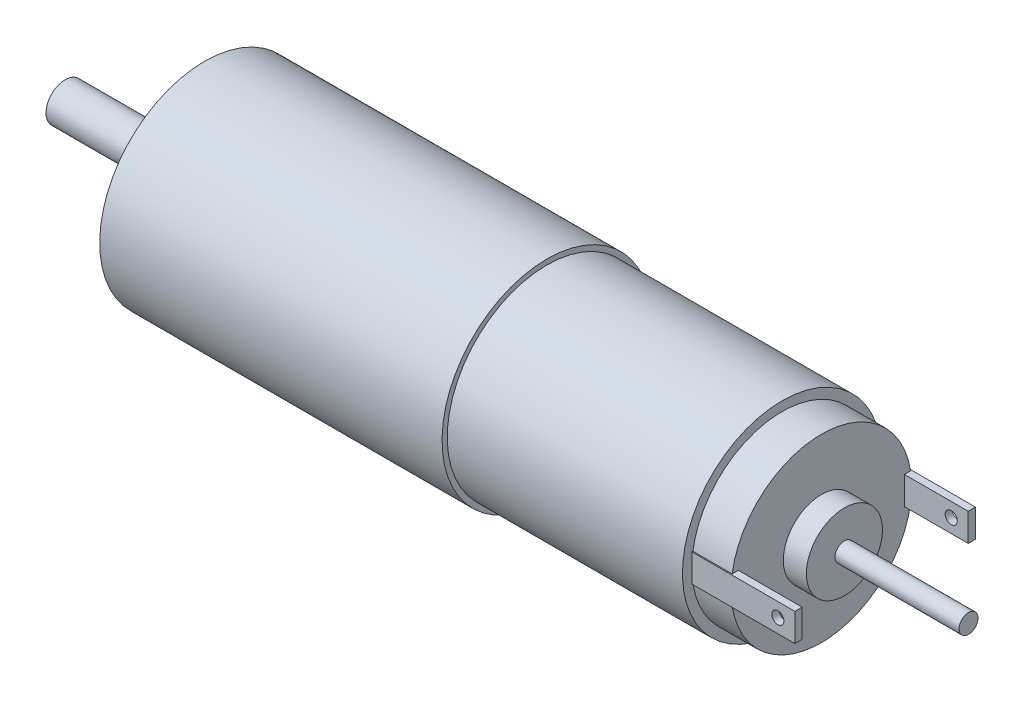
ISO-10303-21;
HEADER;
FILE_DESCRIPTION(('STEP AP214'),'2;1');
FILE_NAME('part.step','',(''),(''),'','','');
FILE_SCHEMA(('AUTOMOTIVE_DESIGN { 1 0 10303 214 1 1 1 1 }'));
ENDSEC;
DATA;
#1=APPLICATION_CONTEXT('core data for automotive mechanical design processes');
#2=APPLICATION_PROTOCOL_DEFINITION('international standard','automotive_design',2000,#1);
#3=PRODUCT_CONTEXT('',#1,'mechanical');
#4=PRODUCT('Part','Part','',(#3));
#5=PRODUCT_RELATED_PRODUCT_CATEGORY('part','',(#4));
#6=PRODUCT_DEFINITION_FORMATION('','',#4);
#7=PRODUCT_DEFINITION_CONTEXT('part definition',#1,'design');
#8=PRODUCT_DEFINITION('design','',#6,#7);
#9=PRODUCT_DEFINITION_SHAPE('','',#8);
#10=(LENGTH_UNIT() NAMED_UNIT(*) SI_UNIT(.MILLI.,.METRE.));
#11=(NAMED_UNIT(*) PLANE_ANGLE_UNIT() SI_UNIT($,.RADIAN.));
#12=(NAMED_UNIT(*) SI_UNIT($,.STERADIAN.) SOLID_ANGLE_UNIT());
#13=UNCERTAINTY_MEASURE_WITH_UNIT(LENGTH_MEASURE(1.E-05),#10,'distance_accuracy_value','');
#14=(GEOMETRIC_REPRESENTATION_CONTEXT(3) GLOBAL_UNCERTAINTY_ASSIGNED_CONTEXT((#13)) GLOBAL_UNIT_ASSIGNED_CONTEXT((#10,
#11,#12)) REPRESENTATION_CONTEXT('',''));
#15=CARTESIAN_POINT('',(0.,0.,0.));
#16=DIRECTION('',(0.,0.,1.));
#17=DIRECTION('',(1.,0.,0.));
#18=AXIS2_PLACEMENT_3D('',#15,#16,#17);
#19=CARTESIAN_POINT('',(35.433,1.4605,8.6995));
#20=DIRECTION('',(0.,0.,-1.));
#21=DIRECTION('',(-1.,0.,0.));
#22=AXIS2_PLACEMENT_3D('',#19,#20,#21);
#23=PLANE('',#22);
#24=DIRECTION('',(0.,-1.,0.));
#25=VECTOR('',#24,1.);
#26=CARTESIAN_POINT('',(28.7528,-9.4615,8.6995));
#27=LINE('',#26,#25);
#28=CARTESIAN_POINT('',(28.7528,1.4605,8.6995));
#29=VERTEX_POINT('',#28);
#30=CARTESIAN_POINT('',(28.7528,-1.4605,8.6995));
#31=VERTEX_POINT('',#30);
#32=EDGE_CURVE('E11',#29,#31,#27,.T.);
#33=ORIENTED_EDGE('',*,*,#32,.F.);
#34=DIRECTION('',(-1.,0.,0.));
#35=VECTOR('',#34,1.);
#36=CARTESIAN_POINT('',(35.433,1.4605,8.6995));
#37=LINE('',#36,#35);
#38=CARTESIAN_POINT('',(35.433,1.4605,8.6995));
#39=VERTEX_POINT('',#38);
#40=EDGE_CURVE('E191',#39,#29,#37,.T.);
#41=ORIENTED_EDGE('',*,*,#40,.F.);
#42=DIRECTION('',(0.,-1.,0.));
#43=VECTOR('',#42,1.);
#44=CARTESIAN_POINT('',(35.433,1.4605,8.6995));
#45=LINE('',#44,#43);
#46=CARTESIAN_POINT('',(35.433,-1.4605,8.6995));
#47=VERTEX_POINT('',#46);
#48=EDGE_CURVE('E170',#39,#47,#45,.T.);
#49=ORIENTED_EDGE('',*,*,#48,.T.);
#50=DIRECTION('',(-1.,0.,0.));
#51=VECTOR('',#50,1.);
#52=CARTESIAN_POINT('',(35.433,-1.4605,8.6995));
#53=LINE('',#52,#51);
#54=EDGE_CURVE('E182',#47,#31,#53,.T.);
#55=ORIENTED_EDGE('',*,*,#54,.T.);
#56=EDGE_LOOP('',(#33,#41,#49,#55));
#57=FACE_BOUND('',#56,.T.);
#58=CARTESIAN_POINT('',(33.655,0.,8.6995));
#59=DIRECTION('',(0.,0.,-1.));
#60=DIRECTION('',(-1.,0.,0.));
#61=AXIS2_PLACEMENT_3D('',#58,#59,#60);
#62=CIRCLE('',#61,0.634999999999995);
#63=CARTESIAN_POINT('',(33.02,0.,8.6995));
#64=VERTEX_POINT('',#63);
#65=EDGE_CURVE('E160',#64,#64,#62,.T.);
#66=ORIENTED_EDGE('',*,*,#65,.F.);
#67=EDGE_LOOP('',(#66));
#68=FACE_BOUND('',#67,.T.);
#69=ADVANCED_FACE('F36',(#57,#68),#23,.T.);
#70=CARTESIAN_POINT('',(35.433,1.4605,9.4615));
#71=DIRECTION('',(0.,0.,1.));
#72=DIRECTION('',(1.,0.,0.));
#73=AXIS2_PLACEMENT_3D('',#70,#71,#72);
#74=PLANE('',#73);
#75=DIRECTION('',(0.,1.,0.));
#76=VECTOR('',#75,1.);
#77=CARTESIAN_POINT('',(24.638,-10.4394,9.4615));
#78=LINE('',#77,#76);
#79=CARTESIAN_POINT('',(24.638,-1.4605,9.4615));
#80=VERTEX_POINT('',#79);
#81=CARTESIAN_POINT('',(24.638,1.4605,9.4615));
#82=VERTEX_POINT('',#81);
#83=EDGE_CURVE('E44',#80,#82,#78,.T.);
#84=ORIENTED_EDGE('',*,*,#83,.F.);
#85=DIRECTION('',(-1.,0.,0.));
#86=VECTOR('',#85,1.);
#87=CARTESIAN_POINT('',(35.433,-1.4605,9.4615));
#88=LINE('',#87,#86);
#89=CARTESIAN_POINT('',(35.433,-1.4605,9.4615));
#90=VERTEX_POINT('',#89);
#91=EDGE_CURVE('E187',#90,#80,#88,.T.);
#92=ORIENTED_EDGE('',*,*,#91,.F.);
#93=DIRECTION('',(0.,1.,0.));
#94=VECTOR('',#93,1.);
#95=CARTESIAN_POINT('',(35.433,1.4605,9.4615));
#96=LINE('',#95,#94);
#97=CARTESIAN_POINT('',(35.433,1.4605,9.4615));
#98=VERTEX_POINT('',#97);
#99=EDGE_CURVE('E176',#90,#98,#96,.T.);
#100=ORIENTED_EDGE('',*,*,#99,.T.);
#101=DIRECTION('',(-1.,0.,0.));
#102=VECTOR('',#101,1.);
#103=CARTESIAN_POINT('',(35.433,1.4605,9.4615));
#104=LINE('',#103,#102);
#105=EDGE_CURVE('E189',#98,#82,#104,.T.);
#106=ORIENTED_EDGE('',*,*,#105,.T.);
#107=EDGE_LOOP('',(#84,#92,#100,#106));
#108=FACE_BOUND('',#107,.T.);
#109=CARTESIAN_POINT('',(33.655,0.,9.4615));
#110=DIRECTION('',(0.,0.,-1.));
#111=DIRECTION('',(-1.,0.,0.));
#112=AXIS2_PLACEMENT_3D('',#109,#110,#111);
#113=CIRCLE('',#112,0.634999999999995);
#114=CARTESIAN_POINT('',(33.02,0.,9.4615));
#115=VERTEX_POINT('',#114);
#116=EDGE_CURVE('E157',#115,#115,#113,.T.);
#117=ORIENTED_EDGE('',*,*,#116,.T.);
#118=EDGE_LOOP('',(#117));
#119=FACE_BOUND('',#118,.T.);
#120=ADVANCED_FACE('F320',(#108,#119),#74,.T.);
#121=CARTESIAN_POINT('',(44.1706,0.,0.));
#122=DIRECTION('',(1.,0.,0.));
#123=DIRECTION('',(0.,1.,0.));
#124=AXIS2_PLACEMENT_3D('',#121,#122,#123);
#125=CYLINDRICAL_SURFACE('',#124,9.4615);
#126=CARTESIAN_POINT('',(24.638,0.,0.));
#127=DIRECTION('',(1.,0.,0.));
#128=DIRECTION('',(0.,1.,0.));
#129=AXIS2_PLACEMENT_3D('',#126,#127,#128);
#130=CIRCLE('',#129,9.4615);
#131=CARTESIAN_POINT('',(24.638,1.4605,-9.3480972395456));
#132=VERTEX_POINT('',#131);
#133=CARTESIAN_POINT('',(24.638,1.4605,9.3480972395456));
#134=VERTEX_POINT('',#133);
#135=EDGE_CURVE('E247',#132,#134,#130,.T.);
#136=ORIENTED_EDGE('',*,*,#135,.T.);
#137=DIRECTION('',(1.,0.,0.));
#138=VECTOR('',#137,1.);
#139=CARTESIAN_POINT('',(44.1706,1.4605,9.3480972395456));
#140=LINE('',#139,#138);
#141=CARTESIAN_POINT('',(28.7528,1.4605,9.3480972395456));
#142=VERTEX_POINT('',#141);
#143=EDGE_CURVE('E200',#134,#142,#140,.T.);
#144=ORIENTED_EDGE('',*,*,#143,.T.);
#145=CARTESIAN_POINT('',(28.7528,0.,0.));
#146=DIRECTION('',(1.,0.,0.));
#147=DIRECTION('',(0.,1.,0.));
#148=AXIS2_PLACEMENT_3D('',#145,#146,#147);
#149=CIRCLE('',#148,9.4615);
#150=CARTESIAN_POINT('',(28.7528,1.4605,-9.3480972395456));
#151=VERTEX_POINT('',#150);
#152=EDGE_CURVE('E251',#151,#142,#149,.T.);
#153=ORIENTED_EDGE('',*,*,#152,.F.);
#154=DIRECTION('',(1.,0.,0.));
#155=VECTOR('',#154,1.);
#156=CARTESIAN_POINT('',(44.1706,1.4605,-9.3480972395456));
#157=LINE('',#156,#155);
#158=EDGE_CURVE('E230',#132,#151,#157,.T.);
#159=ORIENTED_EDGE('',*,*,#158,.F.);
#160=EDGE_LOOP('',(#136,#144,#153,#159));
#161=FACE_BOUND('',#160,.T.);
#162=ADVANCED_FACE('F326',(#161),#125,.T.);
#163=CARTESIAN_POINT('',(28.7528,-9.4615,0.));
#164=DIRECTION('',(-1.,0.,0.));
#165=DIRECTION('',(0.,-1.,0.));
#166=AXIS2_PLACEMENT_3D('',#163,#164,#165);
#167=PLANE('',#166);
#168=CARTESIAN_POINT('',(28.7528,0.,0.));
#169=DIRECTION('',(1.,0.,0.));
#170=DIRECTION('',(0.,1.,0.));
#171=AXIS2_PLACEMENT_3D('',#168,#169,#170);
#172=CIRCLE('',#171,3.9878);
#173=CARTESIAN_POINT('',(28.7528,3.9878,0.));
#174=VERTEX_POINT('',#173);
#175=EDGE_CURVE('E254',#174,#174,#172,.T.);
#176=ORIENTED_EDGE('',*,*,#175,.F.);
#177=EDGE_LOOP('',(#176));
#178=FACE_BOUND('',#177,.T.);
#179=ORIENTED_EDGE('',*,*,#152,.T.);
#180=DIRECTION('',(0.,0.,-1.));
#181=VECTOR('',#180,1.);
#182=CARTESIAN_POINT('',(28.7528,1.4605,0.));
#183=LINE('',#182,#181);
#184=EDGE_CURVE('E203',#142,#29,#183,.T.);
#185=ORIENTED_EDGE('',*,*,#184,.T.);
#186=ORIENTED_EDGE('',*,*,#32,.T.);
#187=DIRECTION('',(0.,0.,1.));
#188=VECTOR('',#187,1.);
#189=CARTESIAN_POINT('',(28.7528,-1.4605,0.));
#190=LINE('',#189,#188);
#191=CARTESIAN_POINT('',(28.7528,-1.4605,9.3480972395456));
#192=VERTEX_POINT('',#191);
#193=EDGE_CURVE('E197',#31,#192,#190,.T.);
#194=ORIENTED_EDGE('',*,*,#193,.T.);
#195=CARTESIAN_POINT('',(28.7528,-1.4605,-9.3480972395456));
#196=VERTEX_POINT('',#195);
#197=EDGE_CURVE('E250',#192,#196,#149,.T.);
#198=ORIENTED_EDGE('',*,*,#197,.T.);
#199=DIRECTION('',(0.,0.,-1.));
#200=VECTOR('',#199,1.);
#201=CARTESIAN_POINT('',(28.7528,-1.4605,0.));
#202=LINE('',#201,#200);
#203=CARTESIAN_POINT('',(28.7528,-1.4605,-8.6995));
#204=VERTEX_POINT('',#203);
#205=EDGE_CURVE('E58',#204,#196,#202,.T.);
#206=ORIENTED_EDGE('',*,*,#205,.F.);
#207=DIRECTION('',(0.,-1.,0.));
#208=VECTOR('',#207,1.);
#209=CARTESIAN_POINT('',(28.7528,-9.4615,-8.6995));
#210=LINE('',#209,#208);
#211=CARTESIAN_POINT('',(28.7528,1.4605,-8.6995));
#212=VERTEX_POINT('',#211);
#213=EDGE_CURVE('E296',#212,#204,#210,.T.);
#214=ORIENTED_EDGE('',*,*,#213,.F.);
#215=DIRECTION('',(0.,0.,1.));
#216=VECTOR('',#215,1.);
#217=CARTESIAN_POINT('',(28.7528,1.4605,0.));
#218=LINE('',#217,#216);
#219=EDGE_CURVE('E233',#151,#212,#218,.T.);
#220=ORIENTED_EDGE('',*,*,#219,.F.);
#221=EDGE_LOOP('',(#179,#185,#186,#194,#198,#206,#214,#220));
#222=FACE_BOUND('',#221,.T.);
#223=ADVANCED_FACE('F311',(#178,#222),#167,.F.);
#224=ORIENTED_EDGE('',*,*,#197,.F.);
#225=DIRECTION('',(1.,0.,0.));
#226=VECTOR('',#225,1.);
#227=CARTESIAN_POINT('',(44.1706,-1.4605,9.3480972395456));
#228=LINE('',#227,#226);
#229=CARTESIAN_POINT('',(24.638,-1.4605,9.3480972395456));
#230=VERTEX_POINT('',#229);
#231=EDGE_CURVE('E194',#192,#230,#228,.F.);
#232=ORIENTED_EDGE('',*,*,#231,.T.);
#233=CARTESIAN_POINT('',(24.638,-1.4605,-9.3480972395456));
#234=VERTEX_POINT('',#233);
#235=EDGE_CURVE('E246',#230,#234,#130,.T.);
#236=ORIENTED_EDGE('',*,*,#235,.T.);
#237=DIRECTION('',(1.,0.,0.));
#238=VECTOR('',#237,1.);
#239=CARTESIAN_POINT('',(44.1706,-1.4605,-9.3480972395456));
#240=LINE('',#239,#238);
#241=EDGE_CURVE('E236',#196,#234,#240,.F.);
#242=ORIENTED_EDGE('',*,*,#241,.F.);
#243=EDGE_LOOP('',(#224,#232,#236,#242));
#244=FACE_BOUND('',#243,.T.);
#245=ADVANCED_FACE('F309',(#244),#125,.T.);
#246=CARTESIAN_POINT('',(24.638,-10.4394,0.));
#247=DIRECTION('',(-1.,0.,0.));
#248=DIRECTION('',(0.,-1.,0.));
#249=AXIS2_PLACEMENT_3D('',#246,#247,#248);
#250=PLANE('',#249);
#251=CARTESIAN_POINT('',(24.638,0.,0.));
#252=DIRECTION('',(1.,0.,0.));
#253=DIRECTION('',(0.,1.,0.));
#254=AXIS2_PLACEMENT_3D('',#251,#252,#253);
#255=CIRCLE('',#254,10.4394);
#256=CARTESIAN_POINT('',(24.638,10.4394,0.));
#257=VERTEX_POINT('',#256);
#258=EDGE_CURVE('E243',#257,#257,#255,.T.);
#259=ORIENTED_EDGE('',*,*,#258,.T.);
#260=EDGE_LOOP('',(#259));
#261=FACE_BOUND('',#260,.T.);
#262=ORIENTED_EDGE('',*,*,#83,.T.);
#263=DIRECTION('',(0.,0.,-1.));
#264=VECTOR('',#263,1.);
#265=CARTESIAN_POINT('',(24.638,1.4605,8.6995));
#266=LINE('',#265,#264);
#267=EDGE_CURVE('E167',#82,#134,#266,.T.);
#268=ORIENTED_EDGE('',*,*,#267,.T.);
#269=ORIENTED_EDGE('',*,*,#135,.F.);
#270=DIRECTION('',(0.,0.,1.));
#271=VECTOR('',#270,1.);
#272=CARTESIAN_POINT('',(24.638,1.4605,-8.6995));
#273=LINE('',#272,#271);
#274=CARTESIAN_POINT('',(24.638,1.4605,-9.4615));
#275=VERTEX_POINT('',#274);
#276=EDGE_CURVE('E206',#275,#132,#273,.T.);
#277=ORIENTED_EDGE('',*,*,#276,.F.);
#278=DIRECTION('',(0.,1.,0.));
#279=VECTOR('',#278,1.);
#280=CARTESIAN_POINT('',(24.638,-10.4394,-9.4615));
#281=LINE('',#280,#279);
#282=CARTESIAN_POINT('',(24.638,-1.4605,-9.4615));
#283=VERTEX_POINT('',#282);
#284=EDGE_CURVE('E290',#283,#275,#281,.T.);
#285=ORIENTED_EDGE('',*,*,#284,.F.);
#286=DIRECTION('',(0.,0.,-1.));
#287=VECTOR('',#286,1.);
#288=CARTESIAN_POINT('',(24.638,-1.4605,0.));
#289=LINE('',#288,#287);
#290=EDGE_CURVE('E293',#234,#283,#289,.T.);
#291=ORIENTED_EDGE('',*,*,#290,.F.);
#292=ORIENTED_EDGE('',*,*,#235,.F.);
#293=DIRECTION('',(0.,0.,1.));
#294=VECTOR('',#293,1.);
#295=CARTESIAN_POINT('',(24.638,-1.4605,0.));
#296=LINE('',#295,#294);
#297=EDGE_CURVE('E298',#230,#80,#296,.T.);
#298=ORIENTED_EDGE('',*,*,#297,.T.);
#299=EDGE_LOOP('',(#262,#268,#269,#277,#285,#291,#292,#298));
#300=FACE_BOUND('',#299,.T.);
#301=ADVANCED_FACE('F301',(#261,#300),#250,.F.);
#302=CARTESIAN_POINT('',(0.,-10.4394,0.));
#303=DIRECTION('',(-1.,0.,0.));
#304=DIRECTION('',(0.,-1.,0.));
#305=AXIS2_PLACEMENT_3D('',#302,#303,#304);
#306=PLANE('',#305);
#307=CARTESIAN_POINT('',(0.,0.,0.));
#308=DIRECTION('',(1.,0.,0.));
#309=DIRECTION('',(0.,1.,0.));
#310=AXIS2_PLACEMENT_3D('',#307,#308,#309);
#311=CIRCLE('',#310,10.4394);
#312=CARTESIAN_POINT('',(0.,10.4394,0.));
#313=VERTEX_POINT('',#312);
#314=EDGE_CURVE('E240',#313,#313,#311,.T.);
#315=ORIENTED_EDGE('',*,*,#314,.F.);
#316=EDGE_LOOP('',(#315));
#317=FACE_BOUND('',#316,.T.);
#318=CARTESIAN_POINT('',(0.,0.,0.));
#319=DIRECTION('',(1.,0.,0.));
#320=DIRECTION('',(0.,1.,0.));
#321=AXIS2_PLACEMENT_3D('',#318,#319,#320);
#322=CIRCLE('',#321,10.9855);
#323=CARTESIAN_POINT('',(0.,10.9855,0.));
#324=VERTEX_POINT('',#323);
#325=EDGE_CURVE('E287',#324,#324,#322,.T.);
#326=ORIENTED_EDGE('',*,*,#325,.T.);
#327=EDGE_LOOP('',(#326));
#328=FACE_BOUND('',#327,.T.);
#329=ADVANCED_FACE('F38',(#317,#328),#306,.F.);
#330=CARTESIAN_POINT('',(44.1706,0.,0.));
#331=DIRECTION('',(1.,0.,0.));
#332=DIRECTION('',(0.,1.,0.));
#333=AXIS2_PLACEMENT_3D('',#330,#331,#332);
#334=CYLINDRICAL_SURFACE('',#333,10.9855);
#335=ORIENTED_EDGE('',*,*,#325,.F.);
#336=EDGE_LOOP('',(#335));
#337=FACE_BOUND('',#336,.T.);
#338=CARTESIAN_POINT('',(-35.8648,0.,0.));
#339=DIRECTION('',(1.,0.,0.));
#340=DIRECTION('',(0.,1.,0.));
#341=AXIS2_PLACEMENT_3D('',#338,#339,#340);
#342=CIRCLE('',#341,10.9855);
#343=CARTESIAN_POINT('',(-35.8648,10.9855,0.));
#344=VERTEX_POINT('',#343);
#345=EDGE_CURVE('E284',#344,#344,#342,.T.);
#346=ORIENTED_EDGE('',*,*,#345,.T.);
#347=EDGE_LOOP('',(#346));
#348=FACE_BOUND('',#347,.T.);
#349=ADVANCED_FACE('F505',(#337,#348),#334,.T.);
#350=CARTESIAN_POINT('',(-35.8648,-10.9855,0.));
#351=DIRECTION('',(1.,0.,0.));
#352=DIRECTION('',(0.,1.,0.));
#353=AXIS2_PLACEMENT_3D('',#350,#351,#352);
#354=PLANE('',#353);
#355=CARTESIAN_POINT('',(-35.8648,6.99506039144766,0.));
#356=DIRECTION('',(-1.,0.,0.));
#357=DIRECTION('',(0.,0.,1.));
#358=AXIS2_PLACEMENT_3D('',#355,#356,#357);
#359=CIRCLE('',#358,0.996949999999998);
#360=CARTESIAN_POINT('',(-35.8648,6.99506039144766,0.996949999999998));
#361=VERTEX_POINT('',#360);
#362=EDGE_CURVE('E140',#361,#361,#359,.T.);
#363=ORIENTED_EDGE('',*,*,#362,.F.);
#364=EDGE_LOOP('',(#363));
#365=FACE_BOUND('',#364,.T.);
#366=CARTESIAN_POINT('',(-35.8648,-3.49753019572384,6.0579));
#367=DIRECTION('',(-1.,0.,0.));
#368=DIRECTION('',(0.,0.,1.));
#369=AXIS2_PLACEMENT_3D('',#366,#367,#368);
#370=CIRCLE('',#369,0.996949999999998);
#371=CARTESIAN_POINT('',(-35.8648,-3.49753019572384,7.05485));
#372=VERTEX_POINT('',#371);
#373=EDGE_CURVE('E148',#372,#372,#370,.T.);
#374=ORIENTED_EDGE('',*,*,#373,.F.);
#375=EDGE_LOOP('',(#374));
#376=FACE_BOUND('',#375,.T.);
#377=CARTESIAN_POINT('',(-35.8648,-3.49753019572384,-6.0579));
#378=DIRECTION('',(-1.,0.,0.));
#379=DIRECTION('',(0.,0.,1.));
#380=AXIS2_PLACEMENT_3D('',#377,#378,#379);
#381=CIRCLE('',#380,0.996949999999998);
#382=CARTESIAN_POINT('',(-35.8648,-3.49753019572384,-5.06095));
#383=VERTEX_POINT('',#382);
#384=EDGE_CURVE('E154',#383,#383,#381,.T.);
#385=ORIENTED_EDGE('',*,*,#384,.F.);
#386=EDGE_LOOP('',(#385));
#387=FACE_BOUND('',#386,.T.);
#388=ORIENTED_EDGE('',*,*,#345,.F.);
#389=EDGE_LOOP('',(#388));
#390=FACE_BOUND('',#389,.T.);
#391=CARTESIAN_POINT('',(-35.8648,0.,0.));
#392=DIRECTION('',(1.,0.,0.));
#393=DIRECTION('',(0.,1.,0.));
#394=AXIS2_PLACEMENT_3D('',#391,#392,#393);
#395=CIRCLE('',#394,5.0038);
#396=CARTESIAN_POINT('',(-35.8648,5.00379999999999,0.));
#397=VERTEX_POINT('',#396);
#398=EDGE_CURVE('E281',#397,#397,#395,.T.);
#399=ORIENTED_EDGE('',*,*,#398,.T.);
#400=EDGE_LOOP('',(#399));
#401=FACE_BOUND('',#400,.T.);
#402=ADVANCED_FACE('F499',(#365,#376,#387,#390,#401),#354,.F.);
#403=CARTESIAN_POINT('',(44.1706,0.,0.));
#404=DIRECTION('',(1.,0.,0.));
#405=DIRECTION('',(0.,1.,0.));
#406=AXIS2_PLACEMENT_3D('',#403,#404,#405);
#407=CYLINDRICAL_SURFACE('',#406,5.0038);
#408=ORIENTED_EDGE('',*,*,#398,.F.);
#409=EDGE_LOOP('',(#408));
#410=FACE_BOUND('',#409,.T.);
#411=CARTESIAN_POINT('',(-37.084,0.,0.));
#412=DIRECTION('',(1.,0.,0.));
#413=DIRECTION('',(0.,1.,0.));
#414=AXIS2_PLACEMENT_3D('',#411,#412,#413);
#415=CIRCLE('',#414,5.0038);
#416=CARTESIAN_POINT('',(-37.084,5.00379999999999,0.));
#417=VERTEX_POINT('',#416);
#418=EDGE_CURVE('E278',#417,#417,#415,.T.);
#419=ORIENTED_EDGE('',*,*,#418,.T.);
#420=EDGE_LOOP('',(#419));
#421=FACE_BOUND('',#420,.T.);
#422=ADVANCED_FACE('F504',(#410,#421),#407,.T.);
#423=CARTESIAN_POINT('',(-37.084,-5.00380000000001,0.));
#424=DIRECTION('',(1.,0.,0.));
#425=DIRECTION('',(0.,1.,0.));
#426=AXIS2_PLACEMENT_3D('',#423,#424,#425);
#427=PLANE('',#426);
#428=ORIENTED_EDGE('',*,*,#418,.F.);
#429=EDGE_LOOP('',(#428));
#430=FACE_BOUND('',#429,.T.);
#431=CARTESIAN_POINT('',(-37.084,0.,0.));
#432=DIRECTION('',(1.,0.,0.));
#433=DIRECTION('',(0.,1.,0.));
#434=AXIS2_PLACEMENT_3D('',#431,#432,#433);
#435=CIRCLE('',#434,3.4925);
#436=CARTESIAN_POINT('',(-37.084,3.49249999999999,0.));
#437=VERTEX_POINT('',#436);
#438=EDGE_CURVE('E275',#437,#437,#435,.T.);
#439=ORIENTED_EDGE('',*,*,#438,.T.);
#440=EDGE_LOOP('',(#439));
#441=FACE_BOUND('',#440,.T.);
#442=ADVANCED_FACE('F589',(#430,#441),#427,.F.);
#443=CARTESIAN_POINT('',(44.1706,0.,0.));
#444=DIRECTION('',(1.,0.,0.));
#445=DIRECTION('',(0.,1.,0.));
#446=AXIS2_PLACEMENT_3D('',#443,#444,#445);
#447=CYLINDRICAL_SURFACE('',#446,3.4925);
#448=ORIENTED_EDGE('',*,*,#438,.F.);
#449=EDGE_LOOP('',(#448));
#450=FACE_BOUND('',#449,.T.);
#451=CARTESIAN_POINT('',(-38.9636,0.,0.));
#452=DIRECTION('',(1.,0.,0.));
#453=DIRECTION('',(0.,1.,0.));
#454=AXIS2_PLACEMENT_3D('',#451,#452,#453);
#455=CIRCLE('',#454,3.4925);
#456=CARTESIAN_POINT('',(-38.9636,3.49249999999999,0.));
#457=VERTEX_POINT('',#456);
#458=EDGE_CURVE('E272',#457,#457,#455,.T.);
#459=ORIENTED_EDGE('',*,*,#458,.T.);
#460=EDGE_LOOP('',(#459));
#461=FACE_BOUND('',#460,.T.);
#462=ADVANCED_FACE('F595',(#450,#461),#447,.T.);
#463=CARTESIAN_POINT('',(-38.9636,-3.49250000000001,0.));
#464=DIRECTION('',(1.,0.,0.));
#465=DIRECTION('',(0.,1.,0.));
#466=AXIS2_PLACEMENT_3D('',#463,#464,#465);
#467=PLANE('',#466);
#468=ORIENTED_EDGE('',*,*,#458,.F.);
#469=EDGE_LOOP('',(#468));
#470=FACE_BOUND('',#469,.T.);
#471=CARTESIAN_POINT('',(-38.9636,0.,0.));
#472=DIRECTION('',(1.,0.,0.));
#473=DIRECTION('',(0.,1.,0.));
#474=AXIS2_PLACEMENT_3D('',#471,#472,#473);
#475=CIRCLE('',#474,2.0066);
#476=CARTESIAN_POINT('',(-38.9636,2.00659999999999,0.));
#477=VERTEX_POINT('',#476);
#478=EDGE_CURVE('E269',#477,#477,#475,.T.);
#479=ORIENTED_EDGE('',*,*,#478,.T.);
#480=EDGE_LOOP('',(#479));
#481=FACE_BOUND('',#480,.T.);
#482=ADVANCED_FACE('F601',(#470,#481),#467,.F.);
#483=CARTESIAN_POINT('',(44.1706,0.,0.));
#484=DIRECTION('',(1.,0.,0.));
#485=DIRECTION('',(0.,1.,0.));
#486=AXIS2_PLACEMENT_3D('',#483,#484,#485);
#487=CYLINDRICAL_SURFACE('',#486,2.0066);
#488=ORIENTED_EDGE('',*,*,#478,.F.);
#489=EDGE_LOOP('',(#488));
#490=FACE_BOUND('',#489,.T.);
#491=CARTESIAN_POINT('',(-50.4698,0.,0.));
#492=DIRECTION('',(1.,0.,0.));
#493=DIRECTION('',(0.,1.,0.));
#494=AXIS2_PLACEMENT_3D('',#491,#492,#493);
#495=CIRCLE('',#494,2.0066);
#496=CARTESIAN_POINT('',(-50.4698,2.00659999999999,0.));
#497=VERTEX_POINT('',#496);
#498=EDGE_CURVE('E266',#497,#497,#495,.T.);
#499=ORIENTED_EDGE('',*,*,#498,.T.);
#500=EDGE_LOOP('',(#499));
#501=FACE_BOUND('',#500,.T.);
#502=ADVANCED_FACE('F607',(#490,#501),#487,.T.);
#503=CARTESIAN_POINT('',(-50.4698,-2.00660000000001,0.));
#504=DIRECTION('',(1.,0.,0.));
#505=DIRECTION('',(0.,1.,0.));
#506=AXIS2_PLACEMENT_3D('',#503,#504,#505);
#507=PLANE('',#506);
#508=ORIENTED_EDGE('',*,*,#498,.F.);
#509=EDGE_LOOP('',(#508));
#510=FACE_BOUND('',#509,.T.);
#511=ADVANCED_FACE('F613',(#510),#507,.F.);
#512=CARTESIAN_POINT('',(44.1706,-0.990600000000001,0.));
#513=DIRECTION('',(-1.,0.,0.));
#514=DIRECTION('',(0.,-1.,0.));
#515=AXIS2_PLACEMENT_3D('',#512,#513,#514);
#516=PLANE('',#515);
#517=CARTESIAN_POINT('',(44.1706,0.,0.));
#518=DIRECTION('',(1.,0.,0.));
#519=DIRECTION('',(0.,1.,0.));
#520=AXIS2_PLACEMENT_3D('',#517,#518,#519);
#521=CIRCLE('',#520,0.990600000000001);
#522=CARTESIAN_POINT('',(44.1706,0.990600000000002,0.));
#523=VERTEX_POINT('',#522);
#524=EDGE_CURVE('E263',#523,#523,#521,.T.);
#525=ORIENTED_EDGE('',*,*,#524,.T.);
#526=EDGE_LOOP('',(#525));
#527=FACE_BOUND('',#526,.T.);
#528=ADVANCED_FACE('F618',(#527),#516,.F.);
#529=CARTESIAN_POINT('',(44.1706,0.,0.));
#530=DIRECTION('',(1.,0.,0.));
#531=DIRECTION('',(0.,1.,0.));
#532=AXIS2_PLACEMENT_3D('',#529,#530,#531);
#533=CYLINDRICAL_SURFACE('',#532,0.990600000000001);
#534=ORIENTED_EDGE('',*,*,#524,.F.);
#535=EDGE_LOOP('',(#534));
#536=FACE_BOUND('',#535,.T.);
#537=CARTESIAN_POINT('',(31.1658,0.,0.));
#538=DIRECTION('',(1.,0.,0.));
#539=DIRECTION('',(0.,1.,0.));
#540=AXIS2_PLACEMENT_3D('',#537,#538,#539);
#541=CIRCLE('',#540,0.9906);
#542=CARTESIAN_POINT('',(31.1658,0.990599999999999,0.));
#543=VERTEX_POINT('',#542);
#544=EDGE_CURVE('E260',#543,#543,#541,.T.);
#545=ORIENTED_EDGE('',*,*,#544,.T.);
#546=EDGE_LOOP('',(#545));
#547=FACE_BOUND('',#546,.T.);
#548=ADVANCED_FACE('F623',(#536,#547),#533,.T.);
#549=CARTESIAN_POINT('',(31.1658,-3.9878,0.));
#550=DIRECTION('',(-1.,0.,0.));
#551=DIRECTION('',(0.,-1.,0.));
#552=AXIS2_PLACEMENT_3D('',#549,#550,#551);
#553=PLANE('',#552);
#554=ORIENTED_EDGE('',*,*,#544,.F.);
#555=EDGE_LOOP('',(#554));
#556=FACE_BOUND('',#555,.T.);
#557=CARTESIAN_POINT('',(31.1658,0.,0.));
#558=DIRECTION('',(1.,0.,0.));
#559=DIRECTION('',(0.,1.,0.));
#560=AXIS2_PLACEMENT_3D('',#557,#558,#559);
#561=CIRCLE('',#560,3.9878);
#562=CARTESIAN_POINT('',(31.1658,3.9878,0.));
#563=VERTEX_POINT('',#562);
#564=EDGE_CURVE('E257',#563,#563,#561,.T.);
#565=ORIENTED_EDGE('',*,*,#564,.T.);
#566=EDGE_LOOP('',(#565));
#567=FACE_BOUND('',#566,.T.);
#568=ADVANCED_FACE('F645',(#556,#567),#553,.F.);
#569=CARTESIAN_POINT('',(44.1706,0.,0.));
#570=DIRECTION('',(1.,0.,0.));
#571=DIRECTION('',(0.,1.,0.));
#572=AXIS2_PLACEMENT_3D('',#569,#570,#571);
#573=CYLINDRICAL_SURFACE('',#572,3.9878);
#574=ORIENTED_EDGE('',*,*,#564,.F.);
#575=EDGE_LOOP('',(#574));
#576=FACE_BOUND('',#575,.T.);
#577=ORIENTED_EDGE('',*,*,#175,.T.);
#578=EDGE_LOOP('',(#577));
#579=FACE_BOUND('',#578,.T.);
#580=ADVANCED_FACE('F639',(#576,#579),#573,.T.);
#581=CARTESIAN_POINT('',(44.1706,0.,0.));
#582=DIRECTION('',(1.,0.,0.));
#583=DIRECTION('',(0.,1.,0.));
#584=AXIS2_PLACEMENT_3D('',#581,#582,#583);
#585=CYLINDRICAL_SURFACE('',#584,10.4394);
#586=ORIENTED_EDGE('',*,*,#258,.F.);
#587=EDGE_LOOP('',(#586));
#588=FACE_BOUND('',#587,.T.);
#589=ORIENTED_EDGE('',*,*,#314,.T.);
#590=EDGE_LOOP('',(#589));
#591=FACE_BOUND('',#590,.T.);
#592=ADVANCED_FACE('F352',(#588,#591),#585,.T.);
#593=CARTESIAN_POINT('',(35.433,1.4605,-8.6995));
#594=DIRECTION('',(0.,0.,-1.));
#595=DIRECTION('',(-1.,0.,0.));
#596=AXIS2_PLACEMENT_3D('',#593,#594,#595);
#597=PLANE('',#596);
#598=CARTESIAN_POINT('',(33.655,0.,-8.6995));
#599=DIRECTION('',(0.,0.,-1.));
#600=DIRECTION('',(-1.,0.,0.));
#601=AXIS2_PLACEMENT_3D('',#598,#599,#600);
#602=CIRCLE('',#601,0.634999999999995);
#603=CARTESIAN_POINT('',(33.02,0.,-8.6995));
#604=VERTEX_POINT('',#603);
#605=EDGE_CURVE('E164',#604,#604,#602,.F.);
#606=ORIENTED_EDGE('',*,*,#605,.F.);
#607=EDGE_LOOP('',(#606));
#608=FACE_BOUND('',#607,.T.);
#609=DIRECTION('',(-1.,0.,0.));
#610=VECTOR('',#609,1.);
#611=CARTESIAN_POINT('',(35.433,1.4605,-8.6995));
#612=LINE('',#611,#610);
#613=CARTESIAN_POINT('',(35.433,1.4605,-8.6995));
#614=VERTEX_POINT('',#613);
#615=EDGE_CURVE('E216',#614,#212,#612,.T.);
#616=ORIENTED_EDGE('',*,*,#615,.T.);
#617=ORIENTED_EDGE('',*,*,#213,.T.);
#618=DIRECTION('',(-1.,0.,0.));
#619=VECTOR('',#618,1.);
#620=CARTESIAN_POINT('',(35.433,-1.4605,-8.6995));
#621=LINE('',#620,#619);
#622=CARTESIAN_POINT('',(35.433,-1.4605,-8.6995));
#623=VERTEX_POINT('',#622);
#624=EDGE_CURVE('E227',#623,#204,#621,.T.);
#625=ORIENTED_EDGE('',*,*,#624,.F.);
#626=DIRECTION('',(0.,-1.,0.));
#627=VECTOR('',#626,1.);
#628=CARTESIAN_POINT('',(35.433,1.4605,-8.6995));
#629=LINE('',#628,#627);
#630=EDGE_CURVE('E207',#614,#623,#629,.T.);
#631=ORIENTED_EDGE('',*,*,#630,.F.);
#632=EDGE_LOOP('',(#616,#617,#625,#631));
#633=FACE_BOUND('',#632,.T.);
#634=ADVANCED_FACE('F334',(#608,#633),#597,.F.);
#635=CARTESIAN_POINT('',(35.433,-1.4605,-8.6995));
#636=DIRECTION('',(0.,1.,0.));
#637=DIRECTION('',(-1.,0.,0.));
#638=AXIS2_PLACEMENT_3D('',#635,#636,#637);
#639=PLANE('',#638);
#640=ORIENTED_EDGE('',*,*,#624,.T.);
#641=ORIENTED_EDGE('',*,*,#205,.T.);
#642=ORIENTED_EDGE('',*,*,#241,.T.);
#643=ORIENTED_EDGE('',*,*,#290,.T.);
#644=DIRECTION('',(-1.,0.,0.));
#645=VECTOR('',#644,1.);
#646=CARTESIAN_POINT('',(35.433,-1.4605,-9.4615));
#647=LINE('',#646,#645);
#648=CARTESIAN_POINT('',(35.433,-1.4605,-9.4615));
#649=VERTEX_POINT('',#648);
#650=EDGE_CURVE('E224',#649,#283,#647,.T.);
#651=ORIENTED_EDGE('',*,*,#650,.F.);
#652=DIRECTION('',(0.,0.,-1.));
#653=VECTOR('',#652,1.);
#654=CARTESIAN_POINT('',(35.433,-1.4605,-8.6995));
#655=LINE('',#654,#653);
#656=EDGE_CURVE('E210',#623,#649,#655,.T.);
#657=ORIENTED_EDGE('',*,*,#656,.F.);
#658=EDGE_LOOP('',(#640,#641,#642,#643,#651,#657));
#659=FACE_BOUND('',#658,.T.);
#660=ADVANCED_FACE('F344',(#659),#639,.F.);
#661=CARTESIAN_POINT('',(35.433,1.4605,-8.6995));
#662=DIRECTION('',(0.,-1.,0.));
#663=DIRECTION('',(1.,0.,0.));
#664=AXIS2_PLACEMENT_3D('',#661,#662,#663);
#665=PLANE('',#664);
#666=ORIENTED_EDGE('',*,*,#158,.T.);
#667=ORIENTED_EDGE('',*,*,#219,.T.);
#668=ORIENTED_EDGE('',*,*,#615,.F.);
#669=DIRECTION('',(0.,0.,1.));
#670=VECTOR('',#669,1.);
#671=CARTESIAN_POINT('',(35.433,1.4605,-8.6995));
#672=LINE('',#671,#670);
#673=CARTESIAN_POINT('',(35.433,1.4605,-9.4615));
#674=VERTEX_POINT('',#673);
#675=EDGE_CURVE('E214',#674,#614,#672,.T.);
#676=ORIENTED_EDGE('',*,*,#675,.F.);
#677=DIRECTION('',(-1.,0.,0.));
#678=VECTOR('',#677,1.);
#679=CARTESIAN_POINT('',(35.433,1.4605,-9.4615));
#680=LINE('',#679,#678);
#681=EDGE_CURVE('E221',#674,#275,#680,.T.);
#682=ORIENTED_EDGE('',*,*,#681,.T.);
#683=ORIENTED_EDGE('',*,*,#276,.T.);
#684=EDGE_LOOP('',(#666,#667,#668,#676,#682,#683));
#685=FACE_BOUND('',#684,.T.);
#686=ADVANCED_FACE('F330',(#685),#665,.F.);
#687=CARTESIAN_POINT('',(35.433,1.4605,-9.4615));
#688=DIRECTION('',(0.,0.,1.));
#689=DIRECTION('',(1.,0.,0.));
#690=AXIS2_PLACEMENT_3D('',#687,#688,#689);
#691=PLANE('',#690);
#692=CARTESIAN_POINT('',(33.655,0.,-9.4615));
#693=DIRECTION('',(0.,0.,-1.));
#694=DIRECTION('',(-1.,0.,0.));
#695=AXIS2_PLACEMENT_3D('',#692,#693,#694);
#696=CIRCLE('',#695,0.634999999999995);
#697=CARTESIAN_POINT('',(33.02,0.,-9.4615));
#698=VERTEX_POINT('',#697);
#699=EDGE_CURVE('E163',#698,#698,#696,.T.);
#700=ORIENTED_EDGE('',*,*,#699,.F.);
#701=EDGE_LOOP('',(#700));
#702=FACE_BOUND('',#701,.T.);
#703=ORIENTED_EDGE('',*,*,#650,.T.);
#704=ORIENTED_EDGE('',*,*,#284,.T.);
#705=ORIENTED_EDGE('',*,*,#681,.F.);
#706=DIRECTION('',(0.,1.,0.));
#707=VECTOR('',#706,1.);
#708=CARTESIAN_POINT('',(35.433,1.4605,-9.4615));
#709=LINE('',#708,#707);
#710=EDGE_CURVE('E212',#649,#674,#709,.T.);
#711=ORIENTED_EDGE('',*,*,#710,.F.);
#712=EDGE_LOOP('',(#703,#704,#705,#711));
#713=FACE_BOUND('',#712,.T.);
#714=ADVANCED_FACE('F342',(#702,#713),#691,.F.);
#715=CARTESIAN_POINT('',(35.433,-1.4605,-8.6995));
#716=DIRECTION('',(1.,0.,0.));
#717=DIRECTION('',(0.,0.,-1.));
#718=AXIS2_PLACEMENT_3D('',#715,#716,#717);
#719=PLANE('',#718);
#720=ORIENTED_EDGE('',*,*,#630,.T.);
#721=ORIENTED_EDGE('',*,*,#656,.T.);
#722=ORIENTED_EDGE('',*,*,#710,.T.);
#723=ORIENTED_EDGE('',*,*,#675,.T.);
#724=EDGE_LOOP('',(#720,#721,#722,#723));
#725=FACE_BOUND('',#724,.T.);
#726=ADVANCED_FACE('F337',(#725),#719,.T.);
#727=CARTESIAN_POINT('',(35.433,1.4605,8.6995));
#728=DIRECTION('',(0.,1.,0.));
#729=DIRECTION('',(-1.,0.,0.));
#730=AXIS2_PLACEMENT_3D('',#727,#728,#729);
#731=PLANE('',#730);
#732=ORIENTED_EDGE('',*,*,#184,.F.);
#733=ORIENTED_EDGE('',*,*,#143,.F.);
#734=ORIENTED_EDGE('',*,*,#267,.F.);
#735=ORIENTED_EDGE('',*,*,#105,.F.);
#736=DIRECTION('',(0.,0.,-1.));
#737=VECTOR('',#736,1.);
#738=CARTESIAN_POINT('',(35.433,1.4605,8.6995));
#739=LINE('',#738,#737);
#740=EDGE_CURVE('E173',#98,#39,#739,.T.);
#741=ORIENTED_EDGE('',*,*,#740,.T.);
#742=ORIENTED_EDGE('',*,*,#40,.T.);
#743=EDGE_LOOP('',(#732,#733,#734,#735,#741,#742));
#744=FACE_BOUND('',#743,.T.);
#745=ADVANCED_FACE('F323',(#744),#731,.T.);
#746=CARTESIAN_POINT('',(35.433,-1.4605,8.6995));
#747=DIRECTION('',(0.,-1.,0.));
#748=DIRECTION('',(1.,0.,0.));
#749=AXIS2_PLACEMENT_3D('',#746,#747,#748);
#750=PLANE('',#749);
#751=ORIENTED_EDGE('',*,*,#193,.F.);
#752=ORIENTED_EDGE('',*,*,#54,.F.);
#753=DIRECTION('',(0.,0.,1.));
#754=VECTOR('',#753,1.);
#755=CARTESIAN_POINT('',(35.433,-1.4605,8.6995));
#756=LINE('',#755,#754);
#757=EDGE_CURVE('E179',#47,#90,#756,.T.);
#758=ORIENTED_EDGE('',*,*,#757,.T.);
#759=ORIENTED_EDGE('',*,*,#91,.T.);
#760=ORIENTED_EDGE('',*,*,#297,.F.);
#761=ORIENTED_EDGE('',*,*,#231,.F.);
#762=EDGE_LOOP('',(#751,#752,#758,#759,#760,#761));
#763=FACE_BOUND('',#762,.T.);
#764=ADVANCED_FACE('F306',(#763),#750,.T.);
#765=CARTESIAN_POINT('',(35.433,-1.4605,8.6995));
#766=DIRECTION('',(1.,0.,0.));
#767=DIRECTION('',(0.,0.,1.));
#768=AXIS2_PLACEMENT_3D('',#765,#766,#767);
#769=PLANE('',#768);
#770=ORIENTED_EDGE('',*,*,#48,.F.);
#771=ORIENTED_EDGE('',*,*,#740,.F.);
#772=ORIENTED_EDGE('',*,*,#99,.F.);
#773=ORIENTED_EDGE('',*,*,#757,.F.);
#774=EDGE_LOOP('',(#770,#771,#772,#773));
#775=FACE_BOUND('',#774,.T.);
#776=ADVANCED_FACE('F319',(#775),#769,.T.);
#777=CARTESIAN_POINT('',(33.655,0.,10.9865));
#778=DIRECTION('',(0.,0.,-1.));
#779=DIRECTION('',(-1.,0.,0.));
#780=AXIS2_PLACEMENT_3D('',#777,#778,#779);
#781=CYLINDRICAL_SURFACE('',#780,0.634999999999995);
#782=ORIENTED_EDGE('',*,*,#699,.T.);
#783=EDGE_LOOP('',(#782));
#784=FACE_BOUND('',#783,.T.);
#785=ORIENTED_EDGE('',*,*,#605,.T.);
#786=EDGE_LOOP('',(#785));
#787=FACE_BOUND('',#786,.T.);
#788=ADVANCED_FACE('F371',(#784,#787),#781,.F.);
#789=CARTESIAN_POINT('',(33.655,0.,-10.9865));
#790=DIRECTION('',(0.,0.,1.));
#791=DIRECTION('',(1.,0.,0.));
#792=AXIS2_PLACEMENT_3D('',#789,#790,#791);
#793=CYLINDRICAL_SURFACE('',#792,0.634999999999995);
#794=ORIENTED_EDGE('',*,*,#65,.T.);
#795=EDGE_LOOP('',(#794));
#796=FACE_BOUND('',#795,.T.);
#797=ORIENTED_EDGE('',*,*,#116,.F.);
#798=EDGE_LOOP('',(#797));
#799=FACE_BOUND('',#798,.T.);
#800=ADVANCED_FACE('F374',(#796,#799),#793,.F.);
#801=CARTESIAN_POINT('',(-35.8648,-3.49753019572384,-6.0579));
#802=DIRECTION('',(-1.,0.,0.));
#803=DIRECTION('',(0.,0.,1.));
#804=AXIS2_PLACEMENT_3D('',#801,#802,#803);
#805=CYLINDRICAL_SURFACE('',#804,0.996949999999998);
#806=CARTESIAN_POINT('',(-28.194,-3.49753019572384,-6.0579));
#807=DIRECTION('',(-1.,0.,0.));
#808=DIRECTION('',(0.,0.,1.));
#809=AXIS2_PLACEMENT_3D('',#806,#807,#808);
#810=CIRCLE('',#809,0.996949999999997);
#811=CARTESIAN_POINT('',(-28.194,-3.49753019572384,-5.06095));
#812=VERTEX_POINT('',#811);
#813=EDGE_CURVE('E151',#812,#812,#810,.T.);
#814=ORIENTED_EDGE('',*,*,#813,.F.);
#815=EDGE_LOOP('',(#814));
#816=FACE_BOUND('',#815,.T.);
#817=ORIENTED_EDGE('',*,*,#384,.T.);
#818=EDGE_LOOP('',(#817));
#819=FACE_BOUND('',#818,.T.);
#820=ADVANCED_FACE('F381',(#816,#819),#805,.F.);
#821=CARTESIAN_POINT('',(-28.194,-3.49753019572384,-6.0579));
#822=DIRECTION('',(-1.,0.,0.));
#823=DIRECTION('',(0.,0.,1.));
#824=AXIS2_PLACEMENT_3D('',#821,#822,#823);
#825=CONICAL_SURFACE('',#824,0.996949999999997,1.02974425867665);
#826=CARTESIAN_POINT('',(-27.5949720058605,-3.49753019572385,-6.0579));
#827=VERTEX_POINT('',#826);
#828=VERTEX_LOOP('',#827);
#829=FACE_BOUND('',#828,.T.);
#830=ORIENTED_EDGE('',*,*,#813,.T.);
#831=EDGE_LOOP('',(#830));
#832=FACE_BOUND('',#831,.T.);
#833=ADVANCED_FACE('F518',(#829,#832),#825,.F.);
#834=CARTESIAN_POINT('',(-35.8648,-3.49753019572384,6.0579));
#835=DIRECTION('',(-1.,0.,0.));
#836=DIRECTION('',(0.,0.,1.));
#837=AXIS2_PLACEMENT_3D('',#834,#835,#836);
#838=CYLINDRICAL_SURFACE('',#837,0.996949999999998);
#839=CARTESIAN_POINT('',(-28.194,-3.49753019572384,6.0579));
#840=DIRECTION('',(-1.,0.,0.));
#841=DIRECTION('',(0.,0.,1.));
#842=AXIS2_PLACEMENT_3D('',#839,#840,#841);
#843=CIRCLE('',#842,0.996949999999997);
#844=CARTESIAN_POINT('',(-28.194,-3.49753019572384,7.05485));
#845=VERTEX_POINT('',#844);
#846=EDGE_CURVE('E143',#845,#845,#843,.T.);
#847=ORIENTED_EDGE('',*,*,#846,.F.);
#848=EDGE_LOOP('',(#847));
#849=FACE_BOUND('',#848,.T.);
#850=ORIENTED_EDGE('',*,*,#373,.T.);
#851=EDGE_LOOP('',(#850));
#852=FACE_BOUND('',#851,.T.);
#853=ADVANCED_FACE('F530',(#849,#852),#838,.F.);
#854=CARTESIAN_POINT('',(-28.194,-3.49753019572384,6.0579));
#855=DIRECTION('',(-1.,0.,0.));
#856=DIRECTION('',(0.,0.,1.));
#857=AXIS2_PLACEMENT_3D('',#854,#855,#856);
#858=CONICAL_SURFACE('',#857,0.996949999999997,1.02974425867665);
#859=CARTESIAN_POINT('',(-27.5949720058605,-3.49753019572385,6.0579));
#860=VERTEX_POINT('',#859);
#861=VERTEX_LOOP('',#860);
#862=FACE_BOUND('',#861,.T.);
#863=ORIENTED_EDGE('',*,*,#846,.T.);
#864=EDGE_LOOP('',(#863));
#865=FACE_BOUND('',#864,.T.);
#866=ADVANCED_FACE('F540',(#862,#865),#858,.F.);
#867=CARTESIAN_POINT('',(-35.8648,6.99506039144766,0.));
#868=DIRECTION('',(-1.,0.,0.));
#869=DIRECTION('',(0.,0.,1.));
#870=AXIS2_PLACEMENT_3D('',#867,#868,#869);
#871=CYLINDRICAL_SURFACE('',#870,0.996949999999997);
#872=CARTESIAN_POINT('',(-28.194,6.99506039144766,0.));
#873=DIRECTION('',(-1.,0.,0.));
#874=DIRECTION('',(0.,0.,1.));
#875=AXIS2_PLACEMENT_3D('',#872,#873,#874);
#876=CIRCLE('',#875,0.996949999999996);
#877=CARTESIAN_POINT('',(-28.194,6.99506039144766,0.996949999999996));
#878=VERTEX_POINT('',#877);
#879=EDGE_CURVE('E138',#878,#878,#876,.T.);
#880=ORIENTED_EDGE('',*,*,#879,.F.);
#881=EDGE_LOOP('',(#880));
#882=FACE_BOUND('',#881,.T.);
#883=ORIENTED_EDGE('',*,*,#362,.T.);
#884=EDGE_LOOP('',(#883));
#885=FACE_BOUND('',#884,.T.);
#886=ADVANCED_FACE('F134',(#882,#885),#871,.F.);
#887=CARTESIAN_POINT('',(-28.194,6.99506039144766,0.));
#888=DIRECTION('',(-1.,0.,0.));
#889=DIRECTION('',(0.,0.,1.));
#890=AXIS2_PLACEMENT_3D('',#887,#888,#889);
#891=CONICAL_SURFACE('',#890,0.996949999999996,1.02974425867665);
#892=CARTESIAN_POINT('',(-27.5949720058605,6.99506039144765,0.));
#893=VERTEX_POINT('',#892);
#894=VERTEX_LOOP('',#893);
#895=FACE_BOUND('',#894,.T.);
#896=ORIENTED_EDGE('',*,*,#879,.T.);
#897=EDGE_LOOP('',(#896));
#898=FACE_BOUND('',#897,.T.);
#899=ADVANCED_FACE('F131',(#895,#898),#891,.F.);
#900=CLOSED_SHELL('',(#69,#120,#162,#223,#245,#301,#329,#349,#402,#422,#442,#462,#482,#502,#511,
#528,#548,#568,#580,#592,#634,#660,#686,#714,#726,#745,#764,#776,#788,#800,#820,#833,#853,#866,
#886,#899));
#901=MANIFOLD_SOLID_BREP('B2',#900);
#902=ADVANCED_BREP_SHAPE_REPRESENTATION('',(#18,#901),#14);
#903=SHAPE_DEFINITION_REPRESENTATION(#9,#902);
ENDSEC;
END-ISO-10303-21;
